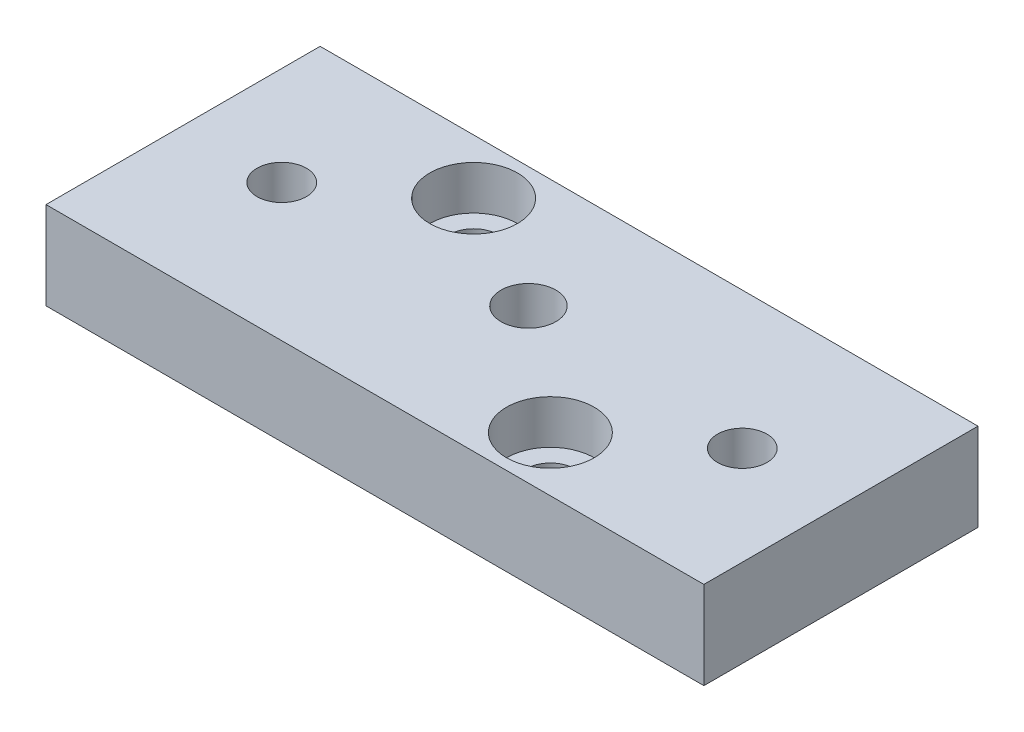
ISO-10303-21;
HEADER;
FILE_DESCRIPTION(('STEP AP214'),'2;1');
FILE_NAME('part.step','',(''),(''),'','','');
FILE_SCHEMA(('AUTOMOTIVE_DESIGN { 1 0 10303 214 1 1 1 1 }'));
ENDSEC;
DATA;
#1=APPLICATION_CONTEXT('core data for automotive mechanical design processes');
#2=APPLICATION_PROTOCOL_DEFINITION('international standard','automotive_design',2000,#1);
#3=PRODUCT_CONTEXT('',#1,'mechanical');
#4=PRODUCT('Part','Part','',(#3));
#5=PRODUCT_RELATED_PRODUCT_CATEGORY('part','',(#4));
#6=PRODUCT_DEFINITION_FORMATION('','',#4);
#7=PRODUCT_DEFINITION_CONTEXT('part definition',#1,'design');
#8=PRODUCT_DEFINITION('design','',#6,#7);
#9=PRODUCT_DEFINITION_SHAPE('','',#8);
#10=(LENGTH_UNIT() NAMED_UNIT(*) SI_UNIT(.MILLI.,.METRE.));
#11=(NAMED_UNIT(*) PLANE_ANGLE_UNIT() SI_UNIT($,.RADIAN.));
#12=(NAMED_UNIT(*) SI_UNIT($,.STERADIAN.) SOLID_ANGLE_UNIT());
#13=UNCERTAINTY_MEASURE_WITH_UNIT(LENGTH_MEASURE(1.E-05),#10,'distance_accuracy_value','');
#14=(GEOMETRIC_REPRESENTATION_CONTEXT(3) GLOBAL_UNCERTAINTY_ASSIGNED_CONTEXT((#13)) GLOBAL_UNIT_ASSIGNED_CONTEXT((#10,
#11,#12)) REPRESENTATION_CONTEXT('',''));
#15=CARTESIAN_POINT('',(0.,0.,0.));
#16=DIRECTION('',(0.,0.,1.));
#17=DIRECTION('',(1.,0.,0.));
#18=AXIS2_PLACEMENT_3D('',#15,#16,#17);
#19=CARTESIAN_POINT('',(21.,0.,0.));
#20=DIRECTION('',(0.,1.,0.));
#21=DIRECTION('',(0.,0.,1.));
#22=AXIS2_PLACEMENT_3D('',#19,#20,#21);
#23=CYLINDRICAL_SURFACE('',#22,2.25);
#24=CARTESIAN_POINT('',(21.,4.,0.));
#25=DIRECTION('',(0.,1.,0.));
#26=DIRECTION('',(0.,0.,1.));
#27=AXIS2_PLACEMENT_3D('',#24,#25,#26);
#28=CIRCLE('',#27,2.25);
#29=CARTESIAN_POINT('',(21.,4.,2.25));
#30=VERTEX_POINT('',#29);
#31=EDGE_CURVE('E20',#30,#30,#28,.T.);
#32=ORIENTED_EDGE('',*,*,#31,.F.);
#33=EDGE_LOOP('',(#32));
#34=FACE_BOUND('',#33,.T.);
#35=CARTESIAN_POINT('',(21.,8.,0.));
#36=DIRECTION('',(0.,1.,0.));
#37=DIRECTION('',(0.,0.,1.));
#38=AXIS2_PLACEMENT_3D('',#35,#36,#37);
#39=CIRCLE('',#38,2.25);
#40=CARTESIAN_POINT('',(21.,8.,2.25));
#41=VERTEX_POINT('',#40);
#42=EDGE_CURVE('E124',#41,#41,#39,.T.);
#43=ORIENTED_EDGE('',*,*,#42,.T.);
#44=EDGE_LOOP('',(#43));
#45=FACE_BOUND('',#44,.T.);
#46=ADVANCED_FACE('F17',(#34,#45),#23,.F.);
#47=CARTESIAN_POINT('',(-21.,0.,0.));
#48=DIRECTION('',(0.,1.,0.));
#49=DIRECTION('',(0.,0.,1.));
#50=AXIS2_PLACEMENT_3D('',#47,#48,#49);
#51=CYLINDRICAL_SURFACE('',#50,2.25);
#52=CARTESIAN_POINT('',(-21.,4.,0.));
#53=DIRECTION('',(0.,1.,0.));
#54=DIRECTION('',(0.,0.,1.));
#55=AXIS2_PLACEMENT_3D('',#52,#53,#54);
#56=CIRCLE('',#55,2.25);
#57=CARTESIAN_POINT('',(-21.,4.,2.25));
#58=VERTEX_POINT('',#57);
#59=EDGE_CURVE('E132',#58,#58,#56,.T.);
#60=ORIENTED_EDGE('',*,*,#59,.F.);
#61=EDGE_LOOP('',(#60));
#62=FACE_BOUND('',#61,.T.);
#63=CARTESIAN_POINT('',(-21.,8.,0.));
#64=DIRECTION('',(0.,1.,0.));
#65=DIRECTION('',(0.,0.,1.));
#66=AXIS2_PLACEMENT_3D('',#63,#64,#65);
#67=CIRCLE('',#66,2.25);
#68=CARTESIAN_POINT('',(-21.,8.,2.25));
#69=VERTEX_POINT('',#68);
#70=EDGE_CURVE('E121',#69,#69,#67,.T.);
#71=ORIENTED_EDGE('',*,*,#70,.T.);
#72=EDGE_LOOP('',(#71));
#73=FACE_BOUND('',#72,.T.);
#74=ADVANCED_FACE('F144',(#62,#73),#51,.F.);
#75=CARTESIAN_POINT('',(11.,4.,7.5));
#76=DIRECTION('',(0.,1.,0.));
#77=DIRECTION('',(0.,0.,1.));
#78=AXIS2_PLACEMENT_3D('',#75,#76,#77);
#79=CYLINDRICAL_SURFACE('',#78,4.);
#80=CARTESIAN_POINT('',(11.,4.,7.5));
#81=DIRECTION('',(0.,1.,0.));
#82=DIRECTION('',(0.,0.,1.));
#83=AXIS2_PLACEMENT_3D('',#80,#81,#82);
#84=CIRCLE('',#83,4.);
#85=CARTESIAN_POINT('',(11.,4.,11.5));
#86=VERTEX_POINT('',#85);
#87=EDGE_CURVE('E130',#86,#86,#84,.T.);
#88=ORIENTED_EDGE('',*,*,#87,.F.);
#89=EDGE_LOOP('',(#88));
#90=FACE_BOUND('',#89,.T.);
#91=CARTESIAN_POINT('',(11.,8.,7.5));
#92=DIRECTION('',(0.,1.,0.));
#93=DIRECTION('',(0.,0.,1.));
#94=AXIS2_PLACEMENT_3D('',#91,#92,#93);
#95=CIRCLE('',#94,4.);
#96=CARTESIAN_POINT('',(11.,8.,11.5));
#97=VERTEX_POINT('',#96);
#98=EDGE_CURVE('E118',#97,#97,#95,.T.);
#99=ORIENTED_EDGE('',*,*,#98,.T.);
#100=EDGE_LOOP('',(#99));
#101=FACE_BOUND('',#100,.T.);
#102=ADVANCED_FACE('F220',(#90,#101),#79,.F.);
#103=CARTESIAN_POINT('',(-11.,4.,-7.5));
#104=DIRECTION('',(0.,1.,0.));
#105=DIRECTION('',(0.,0.,1.));
#106=AXIS2_PLACEMENT_3D('',#103,#104,#105);
#107=CYLINDRICAL_SURFACE('',#106,4.);
#108=CARTESIAN_POINT('',(-11.,4.,-7.5));
#109=DIRECTION('',(0.,1.,0.));
#110=DIRECTION('',(0.,0.,1.));
#111=AXIS2_PLACEMENT_3D('',#108,#109,#110);
#112=CIRCLE('',#111,4.);
#113=CARTESIAN_POINT('',(-11.,4.,-3.5));
#114=VERTEX_POINT('',#113);
#115=EDGE_CURVE('E127',#114,#114,#112,.T.);
#116=ORIENTED_EDGE('',*,*,#115,.F.);
#117=EDGE_LOOP('',(#116));
#118=FACE_BOUND('',#117,.T.);
#119=CARTESIAN_POINT('',(-11.,8.,-7.5));
#120=DIRECTION('',(0.,1.,0.));
#121=DIRECTION('',(0.,0.,1.));
#122=AXIS2_PLACEMENT_3D('',#119,#120,#121);
#123=CIRCLE('',#122,4.);
#124=CARTESIAN_POINT('',(-11.,8.,-3.5));
#125=VERTEX_POINT('',#124);
#126=EDGE_CURVE('E115',#125,#125,#123,.T.);
#127=ORIENTED_EDGE('',*,*,#126,.T.);
#128=EDGE_LOOP('',(#127));
#129=FACE_BOUND('',#128,.T.);
#130=ADVANCED_FACE('F212',(#118,#129),#107,.F.);
#131=CARTESIAN_POINT('',(21.,4.,0.));
#132=DIRECTION('',(0.,-1.,0.));
#133=DIRECTION('',(0.,0.,-1.));
#134=AXIS2_PLACEMENT_3D('',#131,#132,#133);
#135=PLANE('',#134);
#136=ORIENTED_EDGE('',*,*,#31,.T.);
#137=EDGE_LOOP('',(#136));
#138=FACE_BOUND('',#137,.T.);
#139=CARTESIAN_POINT('',(21.,4.,0.));
#140=DIRECTION('',(0.,-1.,0.));
#141=DIRECTION('',(0.,0.,-1.));
#142=AXIS2_PLACEMENT_3D('',#139,#140,#141);
#143=CIRCLE('',#142,4.);
#144=CARTESIAN_POINT('',(21.,4.,-4.));
#145=VERTEX_POINT('',#144);
#146=EDGE_CURVE('E112',#145,#145,#143,.T.);
#147=ORIENTED_EDGE('',*,*,#146,.T.);
#148=EDGE_LOOP('',(#147));
#149=FACE_BOUND('',#148,.T.);
#150=ADVANCED_FACE('F139',(#138,#149),#135,.T.);
#151=CARTESIAN_POINT('',(-21.,4.,0.));
#152=DIRECTION('',(0.,-1.,0.));
#153=DIRECTION('',(0.,0.,-1.));
#154=AXIS2_PLACEMENT_3D('',#151,#152,#153);
#155=PLANE('',#154);
#156=ORIENTED_EDGE('',*,*,#59,.T.);
#157=EDGE_LOOP('',(#156));
#158=FACE_BOUND('',#157,.T.);
#159=CARTESIAN_POINT('',(-21.,4.,0.));
#160=DIRECTION('',(0.,-1.,0.));
#161=DIRECTION('',(0.,0.,-1.));
#162=AXIS2_PLACEMENT_3D('',#159,#160,#161);
#163=CIRCLE('',#162,4.);
#164=CARTESIAN_POINT('',(-21.,4.,-4.));
#165=VERTEX_POINT('',#164);
#166=EDGE_CURVE('E109',#165,#165,#163,.T.);
#167=ORIENTED_EDGE('',*,*,#166,.T.);
#168=EDGE_LOOP('',(#167));
#169=FACE_BOUND('',#168,.T.);
#170=ADVANCED_FACE('F211',(#158,#169),#155,.T.);
#171=CARTESIAN_POINT('',(11.,4.,7.5));
#172=DIRECTION('',(0.,1.,0.));
#173=DIRECTION('',(0.,0.,1.));
#174=AXIS2_PLACEMENT_3D('',#171,#172,#173);
#175=PLANE('',#174);
#176=CARTESIAN_POINT('',(11.,4.,7.5));
#177=DIRECTION('',(0.,1.,0.));
#178=DIRECTION('',(0.,0.,1.));
#179=AXIS2_PLACEMENT_3D('',#176,#177,#178);
#180=CIRCLE('',#179,2.25);
#181=CARTESIAN_POINT('',(11.,4.,9.75));
#182=VERTEX_POINT('',#181);
#183=EDGE_CURVE('E103',#182,#182,#180,.F.);
#184=ORIENTED_EDGE('',*,*,#183,.T.);
#185=EDGE_LOOP('',(#184));
#186=FACE_BOUND('',#185,.T.);
#187=ORIENTED_EDGE('',*,*,#87,.T.);
#188=EDGE_LOOP('',(#187));
#189=FACE_BOUND('',#188,.T.);
#190=ADVANCED_FACE('F218',(#186,#189),#175,.T.);
#191=CARTESIAN_POINT('',(-11.,4.,-7.5));
#192=DIRECTION('',(0.,1.,0.));
#193=DIRECTION('',(0.,0.,1.));
#194=AXIS2_PLACEMENT_3D('',#191,#192,#193);
#195=PLANE('',#194);
#196=CARTESIAN_POINT('',(-11.,4.,-7.5));
#197=DIRECTION('',(0.,1.,0.));
#198=DIRECTION('',(0.,0.,1.));
#199=AXIS2_PLACEMENT_3D('',#196,#197,#198);
#200=CIRCLE('',#199,2.25);
#201=CARTESIAN_POINT('',(-11.,4.,-5.25));
#202=VERTEX_POINT('',#201);
#203=EDGE_CURVE('E74',#202,#202,#200,.F.);
#204=ORIENTED_EDGE('',*,*,#203,.T.);
#205=EDGE_LOOP('',(#204));
#206=FACE_BOUND('',#205,.T.);
#207=ORIENTED_EDGE('',*,*,#115,.T.);
#208=EDGE_LOOP('',(#207));
#209=FACE_BOUND('',#208,.T.);
#210=ADVANCED_FACE('F150',(#206,#209),#195,.T.);
#211=CARTESIAN_POINT('',(0.,8.,0.));
#212=DIRECTION('',(0.,-1.,0.));
#213=DIRECTION('',(0.,0.,-1.));
#214=AXIS2_PLACEMENT_3D('',#211,#212,#213);
#215=PLANE('',#214);
#216=DIRECTION('',(1.,0.,0.));
#217=VECTOR('',#216,1.);
#218=CARTESIAN_POINT('',(-30.,8.,-12.5));
#219=LINE('',#218,#217);
#220=CARTESIAN_POINT('',(30.,8.,-12.5));
#221=VERTEX_POINT('',#220);
#222=CARTESIAN_POINT('',(-30.,8.,-12.5));
#223=VERTEX_POINT('',#222);
#224=EDGE_CURVE('E393',#221,#223,#219,.F.);
#225=ORIENTED_EDGE('',*,*,#224,.T.);
#226=DIRECTION('',(0.,0.,-1.));
#227=VECTOR('',#226,1.);
#228=CARTESIAN_POINT('',(-30.,8.,12.5));
#229=LINE('',#228,#227);
#230=CARTESIAN_POINT('',(-30.,8.,12.5));
#231=VERTEX_POINT('',#230);
#232=EDGE_CURVE('E55',#223,#231,#229,.F.);
#233=ORIENTED_EDGE('',*,*,#232,.T.);
#234=DIRECTION('',(-1.,0.,0.));
#235=VECTOR('',#234,1.);
#236=CARTESIAN_POINT('',(-30.,8.,12.5));
#237=LINE('',#236,#235);
#238=CARTESIAN_POINT('',(30.,8.,12.5));
#239=VERTEX_POINT('',#238);
#240=EDGE_CURVE('E57',#231,#239,#237,.F.);
#241=ORIENTED_EDGE('',*,*,#240,.T.);
#242=DIRECTION('',(0.,0.,1.));
#243=VECTOR('',#242,1.);
#244=CARTESIAN_POINT('',(30.,8.,12.5));
#245=LINE('',#244,#243);
#246=EDGE_CURVE('E61',#239,#221,#245,.F.);
#247=ORIENTED_EDGE('',*,*,#246,.T.);
#248=EDGE_LOOP('',(#225,#233,#241,#247));
#249=FACE_BOUND('',#248,.T.);
#250=ORIENTED_EDGE('',*,*,#126,.F.);
#251=EDGE_LOOP('',(#250));
#252=FACE_BOUND('',#251,.T.);
#253=ORIENTED_EDGE('',*,*,#98,.F.);
#254=EDGE_LOOP('',(#253));
#255=FACE_BOUND('',#254,.T.);
#256=ORIENTED_EDGE('',*,*,#70,.F.);
#257=EDGE_LOOP('',(#256));
#258=FACE_BOUND('',#257,.T.);
#259=ORIENTED_EDGE('',*,*,#42,.F.);
#260=EDGE_LOOP('',(#259));
#261=FACE_BOUND('',#260,.T.);
#262=CARTESIAN_POINT('',(0.,8.,-1.5));
#263=DIRECTION('',(0.,1.,0.));
#264=DIRECTION('',(0.,0.,1.));
#265=AXIS2_PLACEMENT_3D('',#262,#263,#264);
#266=CIRCLE('',#265,2.5);
#267=CARTESIAN_POINT('',(0.,8.,0.999999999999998));
#268=VERTEX_POINT('',#267);
#269=EDGE_CURVE('E106',#268,#268,#266,.F.);
#270=ORIENTED_EDGE('',*,*,#269,.T.);
#271=EDGE_LOOP('',(#270));
#272=FACE_BOUND('',#271,.T.);
#273=ADVANCED_FACE('F59',(#249,#252,#255,#258,#261,#272),#215,.F.);
#274=CARTESIAN_POINT('',(21.,4.,0.));
#275=DIRECTION('',(0.,-1.,0.));
#276=DIRECTION('',(0.,0.,-1.));
#277=AXIS2_PLACEMENT_3D('',#274,#275,#276);
#278=CYLINDRICAL_SURFACE('',#277,4.);
#279=CARTESIAN_POINT('',(21.,0.,0.));
#280=DIRECTION('',(0.,-1.,0.));
#281=DIRECTION('',(0.,0.,-1.));
#282=AXIS2_PLACEMENT_3D('',#279,#280,#281);
#283=CIRCLE('',#282,4.);
#284=CARTESIAN_POINT('',(21.,0.,-4.));
#285=VERTEX_POINT('',#284);
#286=EDGE_CURVE('E98',#285,#285,#283,.F.);
#287=ORIENTED_EDGE('',*,*,#286,.F.);
#288=EDGE_LOOP('',(#287));
#289=FACE_BOUND('',#288,.T.);
#290=ORIENTED_EDGE('',*,*,#146,.F.);
#291=EDGE_LOOP('',(#290));
#292=FACE_BOUND('',#291,.T.);
#293=ADVANCED_FACE('F149',(#289,#292),#278,.F.);
#294=CARTESIAN_POINT('',(-21.,4.,0.));
#295=DIRECTION('',(0.,-1.,0.));
#296=DIRECTION('',(0.,0.,-1.));
#297=AXIS2_PLACEMENT_3D('',#294,#295,#296);
#298=CYLINDRICAL_SURFACE('',#297,4.);
#299=CARTESIAN_POINT('',(-21.,0.,0.));
#300=DIRECTION('',(0.,-1.,0.));
#301=DIRECTION('',(0.,0.,-1.));
#302=AXIS2_PLACEMENT_3D('',#299,#300,#301);
#303=CIRCLE('',#302,4.);
#304=CARTESIAN_POINT('',(-21.,0.,-4.));
#305=VERTEX_POINT('',#304);
#306=EDGE_CURVE('E95',#305,#305,#303,.F.);
#307=ORIENTED_EDGE('',*,*,#306,.F.);
#308=EDGE_LOOP('',(#307));
#309=FACE_BOUND('',#308,.T.);
#310=ORIENTED_EDGE('',*,*,#166,.F.);
#311=EDGE_LOOP('',(#310));
#312=FACE_BOUND('',#311,.T.);
#313=ADVANCED_FACE('F157',(#309,#312),#298,.F.);
#314=CARTESIAN_POINT('',(0.,8.,-1.5));
#315=DIRECTION('',(0.,1.,0.));
#316=DIRECTION('',(0.,0.,1.));
#317=AXIS2_PLACEMENT_3D('',#314,#315,#316);
#318=CYLINDRICAL_SURFACE('',#317,2.5);
#319=CARTESIAN_POINT('',(0.,0.,-1.5));
#320=DIRECTION('',(0.,1.,0.));
#321=DIRECTION('',(0.,0.,1.));
#322=AXIS2_PLACEMENT_3D('',#319,#320,#321);
#323=CIRCLE('',#322,2.5);
#324=CARTESIAN_POINT('',(0.,0.,0.999999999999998));
#325=VERTEX_POINT('',#324);
#326=EDGE_CURVE('E92',#325,#325,#323,.T.);
#327=ORIENTED_EDGE('',*,*,#326,.F.);
#328=EDGE_LOOP('',(#327));
#329=FACE_BOUND('',#328,.T.);
#330=ORIENTED_EDGE('',*,*,#269,.F.);
#331=EDGE_LOOP('',(#330));
#332=FACE_BOUND('',#331,.T.);
#333=ADVANCED_FACE('F154',(#329,#332),#318,.F.);
#334=CARTESIAN_POINT('',(11.,0.,7.5));
#335=DIRECTION('',(0.,1.,0.));
#336=DIRECTION('',(0.,0.,1.));
#337=AXIS2_PLACEMENT_3D('',#334,#335,#336);
#338=CYLINDRICAL_SURFACE('',#337,2.25);
#339=ORIENTED_EDGE('',*,*,#183,.F.);
#340=EDGE_LOOP('',(#339));
#341=FACE_BOUND('',#340,.T.);
#342=CARTESIAN_POINT('',(11.,0.,7.5));
#343=DIRECTION('',(0.,1.,0.));
#344=DIRECTION('',(0.,0.,1.));
#345=AXIS2_PLACEMENT_3D('',#342,#343,#344);
#346=CIRCLE('',#345,2.25);
#347=CARTESIAN_POINT('',(11.,0.,9.75));
#348=VERTEX_POINT('',#347);
#349=EDGE_CURVE('E89',#348,#348,#346,.T.);
#350=ORIENTED_EDGE('',*,*,#349,.F.);
#351=EDGE_LOOP('',(#350));
#352=FACE_BOUND('',#351,.T.);
#353=ADVANCED_FACE('F156',(#341,#352),#338,.F.);
#354=CARTESIAN_POINT('',(-11.,0.,-7.5));
#355=DIRECTION('',(0.,1.,0.));
#356=DIRECTION('',(0.,0.,1.));
#357=AXIS2_PLACEMENT_3D('',#354,#355,#356);
#358=CYLINDRICAL_SURFACE('',#357,2.25);
#359=ORIENTED_EDGE('',*,*,#203,.F.);
#360=EDGE_LOOP('',(#359));
#361=FACE_BOUND('',#360,.T.);
#362=CARTESIAN_POINT('',(-11.,0.,-7.5));
#363=DIRECTION('',(0.,1.,0.));
#364=DIRECTION('',(0.,0.,1.));
#365=AXIS2_PLACEMENT_3D('',#362,#363,#364);
#366=CIRCLE('',#365,2.25);
#367=CARTESIAN_POINT('',(-11.,0.,-5.25));
#368=VERTEX_POINT('',#367);
#369=EDGE_CURVE('E85',#368,#368,#366,.T.);
#370=ORIENTED_EDGE('',*,*,#369,.F.);
#371=EDGE_LOOP('',(#370));
#372=FACE_BOUND('',#371,.T.);
#373=ADVANCED_FACE('F165',(#361,#372),#358,.F.);
#374=CARTESIAN_POINT('',(30.,8.,12.5));
#375=DIRECTION('',(-1.,0.,0.));
#376=DIRECTION('',(0.,0.,1.));
#377=AXIS2_PLACEMENT_3D('',#374,#375,#376);
#378=PLANE('',#377);
#379=DIRECTION('',(0.,1.,0.));
#380=VECTOR('',#379,1.);
#381=CARTESIAN_POINT('',(30.,8.,-12.5));
#382=LINE('',#381,#380);
#383=CARTESIAN_POINT('',(30.,0.,-12.5));
#384=VERTEX_POINT('',#383);
#385=EDGE_CURVE('E72',#384,#221,#382,.T.);
#386=ORIENTED_EDGE('',*,*,#385,.T.);
#387=ORIENTED_EDGE('',*,*,#246,.F.);
#388=DIRECTION('',(0.,1.,0.));
#389=VECTOR('',#388,1.);
#390=CARTESIAN_POINT('',(30.,8.,12.5));
#391=LINE('',#390,#389);
#392=CARTESIAN_POINT('',(30.,0.,12.5));
#393=VERTEX_POINT('',#392);
#394=EDGE_CURVE('E66',#239,#393,#391,.F.);
#395=ORIENTED_EDGE('',*,*,#394,.T.);
#396=DIRECTION('',(0.,0.,-1.));
#397=VECTOR('',#396,1.);
#398=CARTESIAN_POINT('',(30.,0.,0.));
#399=LINE('',#398,#397);
#400=EDGE_CURVE('E88',#384,#393,#399,.F.);
#401=ORIENTED_EDGE('',*,*,#400,.F.);
#402=EDGE_LOOP('',(#386,#387,#395,#401));
#403=FACE_BOUND('',#402,.T.);
#404=ADVANCED_FACE('F69',(#403),#378,.F.);
#405=CARTESIAN_POINT('',(-30.,8.,12.5));
#406=DIRECTION('',(0.,0.,-1.));
#407=DIRECTION('',(-1.,0.,0.));
#408=AXIS2_PLACEMENT_3D('',#405,#406,#407);
#409=PLANE('',#408);
#410=ORIENTED_EDGE('',*,*,#394,.F.);
#411=ORIENTED_EDGE('',*,*,#240,.F.);
#412=DIRECTION('',(0.,1.,0.));
#413=VECTOR('',#412,1.);
#414=CARTESIAN_POINT('',(-30.,8.,12.5));
#415=LINE('',#414,#413);
#416=CARTESIAN_POINT('',(-30.,0.,12.5));
#417=VERTEX_POINT('',#416);
#418=EDGE_CURVE('E81',#231,#417,#415,.F.);
#419=ORIENTED_EDGE('',*,*,#418,.T.);
#420=DIRECTION('',(1.,0.,0.));
#421=VECTOR('',#420,1.);
#422=CARTESIAN_POINT('',(0.,0.,12.5));
#423=LINE('',#422,#421);
#424=EDGE_CURVE('E78',#393,#417,#423,.F.);
#425=ORIENTED_EDGE('',*,*,#424,.F.);
#426=EDGE_LOOP('',(#410,#411,#419,#425));
#427=FACE_BOUND('',#426,.T.);
#428=ADVANCED_FACE('F76',(#427),#409,.F.);
#429=CARTESIAN_POINT('',(-30.,8.,12.5));
#430=DIRECTION('',(1.,0.,0.));
#431=DIRECTION('',(0.,0.,-1.));
#432=AXIS2_PLACEMENT_3D('',#429,#430,#431);
#433=PLANE('',#432);
#434=ORIENTED_EDGE('',*,*,#418,.F.);
#435=ORIENTED_EDGE('',*,*,#232,.F.);
#436=DIRECTION('',(0.,1.,0.));
#437=VECTOR('',#436,1.);
#438=CARTESIAN_POINT('',(-30.,8.,-12.5));
#439=LINE('',#438,#437);
#440=CARTESIAN_POINT('',(-30.,0.,-12.5));
#441=VERTEX_POINT('',#440);
#442=EDGE_CURVE('E35',#223,#441,#439,.F.);
#443=ORIENTED_EDGE('',*,*,#442,.T.);
#444=DIRECTION('',(0.,0.,-1.));
#445=VECTOR('',#444,1.);
#446=CARTESIAN_POINT('',(-30.,0.,0.));
#447=LINE('',#446,#445);
#448=EDGE_CURVE('E26',#417,#441,#447,.T.);
#449=ORIENTED_EDGE('',*,*,#448,.F.);
#450=EDGE_LOOP('',(#434,#435,#443,#449));
#451=FACE_BOUND('',#450,.T.);
#452=ADVANCED_FACE('F179',(#451),#433,.F.);
#453=CARTESIAN_POINT('',(-30.,8.,-12.5));
#454=DIRECTION('',(0.,0.,1.));
#455=DIRECTION('',(1.,0.,0.));
#456=AXIS2_PLACEMENT_3D('',#453,#454,#455);
#457=PLANE('',#456);
#458=ORIENTED_EDGE('',*,*,#442,.F.);
#459=ORIENTED_EDGE('',*,*,#224,.F.);
#460=ORIENTED_EDGE('',*,*,#385,.F.);
#461=DIRECTION('',(1.,0.,0.));
#462=VECTOR('',#461,1.);
#463=CARTESIAN_POINT('',(0.,0.,-12.5));
#464=LINE('',#463,#462);
#465=EDGE_CURVE('E11',#441,#384,#464,.T.);
#466=ORIENTED_EDGE('',*,*,#465,.F.);
#467=EDGE_LOOP('',(#458,#459,#460,#466));
#468=FACE_BOUND('',#467,.T.);
#469=ADVANCED_FACE('F173',(#468),#457,.F.);
#470=CARTESIAN_POINT('',(0.,0.,0.));
#471=DIRECTION('',(0.,-1.,0.));
#472=DIRECTION('',(0.,0.,-1.));
#473=AXIS2_PLACEMENT_3D('',#470,#471,#472);
#474=PLANE('',#473);
#475=ORIENTED_EDGE('',*,*,#448,.T.);
#476=ORIENTED_EDGE('',*,*,#465,.T.);
#477=ORIENTED_EDGE('',*,*,#400,.T.);
#478=ORIENTED_EDGE('',*,*,#424,.T.);
#479=EDGE_LOOP('',(#475,#476,#477,#478));
#480=FACE_BOUND('',#479,.T.);
#481=ORIENTED_EDGE('',*,*,#369,.T.);
#482=EDGE_LOOP('',(#481));
#483=FACE_BOUND('',#482,.T.);
#484=ORIENTED_EDGE('',*,*,#349,.T.);
#485=EDGE_LOOP('',(#484));
#486=FACE_BOUND('',#485,.T.);
#487=ORIENTED_EDGE('',*,*,#326,.T.);
#488=EDGE_LOOP('',(#487));
#489=FACE_BOUND('',#488,.T.);
#490=ORIENTED_EDGE('',*,*,#306,.T.);
#491=EDGE_LOOP('',(#490));
#492=FACE_BOUND('',#491,.T.);
#493=ORIENTED_EDGE('',*,*,#286,.T.);
#494=EDGE_LOOP('',(#493));
#495=FACE_BOUND('',#494,.T.);
#496=ADVANCED_FACE('F171',(#480,#483,#486,#489,#492,#495),#474,.T.);
#497=CLOSED_SHELL('',(#46,#74,#102,#130,#150,#170,#190,#210,#273,#293,#313,#333,#353,#373,#404,
#428,#452,#469,#496));
#498=MANIFOLD_SOLID_BREP('B1',#497);
#499=ADVANCED_BREP_SHAPE_REPRESENTATION('',(#18,#498),#14);
#500=SHAPE_DEFINITION_REPRESENTATION(#9,#499);
ENDSEC;
END-ISO-10303-21;
